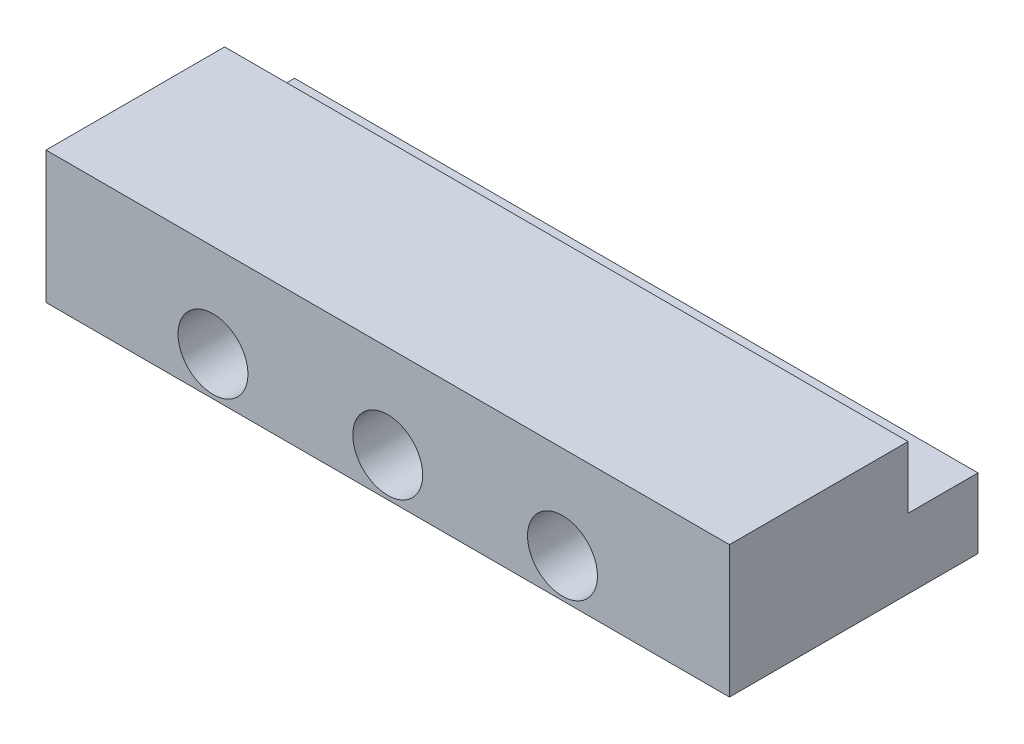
ISO-10303-21;
HEADER;
FILE_DESCRIPTION(('STEP AP214'),'2;1');
FILE_NAME('part.step','',(''),(''),'','','');
FILE_SCHEMA(('AUTOMOTIVE_DESIGN { 1 0 10303 214 1 1 1 1 }'));
ENDSEC;
DATA;
#1=APPLICATION_CONTEXT('core data for automotive mechanical design processes');
#2=APPLICATION_PROTOCOL_DEFINITION('international standard','automotive_design',2000,#1);
#3=PRODUCT_CONTEXT('',#1,'mechanical');
#4=PRODUCT('Part','Part','',(#3));
#5=PRODUCT_RELATED_PRODUCT_CATEGORY('part','',(#4));
#6=PRODUCT_DEFINITION_FORMATION('','',#4);
#7=PRODUCT_DEFINITION_CONTEXT('part definition',#1,'design');
#8=PRODUCT_DEFINITION('design','',#6,#7);
#9=PRODUCT_DEFINITION_SHAPE('','',#8);
#10=(LENGTH_UNIT() NAMED_UNIT(*) SI_UNIT(.MILLI.,.METRE.));
#11=(NAMED_UNIT(*) PLANE_ANGLE_UNIT() SI_UNIT($,.RADIAN.));
#12=(NAMED_UNIT(*) SI_UNIT($,.STERADIAN.) SOLID_ANGLE_UNIT());
#13=UNCERTAINTY_MEASURE_WITH_UNIT(LENGTH_MEASURE(1.E-05),#10,'distance_accuracy_value','');
#14=(GEOMETRIC_REPRESENTATION_CONTEXT(3) GLOBAL_UNCERTAINTY_ASSIGNED_CONTEXT((#13)) GLOBAL_UNIT_ASSIGNED_CONTEXT((#10,
#11,#12)) REPRESENTATION_CONTEXT('',''));
#15=CARTESIAN_POINT('',(0.,0.,0.));
#16=DIRECTION('',(0.,0.,1.));
#17=DIRECTION('',(1.,0.,0.));
#18=AXIS2_PLACEMENT_3D('',#15,#16,#17);
#19=CARTESIAN_POINT('',(-110.,85.25,-40.));
#20=DIRECTION('',(-1.,0.,0.));
#21=DIRECTION('',(0.,-1.,0.));
#22=AXIS2_PLACEMENT_3D('',#19,#20,#21);
#23=PLANE('',#22);
#24=DIRECTION('',(0.,-1.,0.));
#25=VECTOR('',#24,1.);
#26=CARTESIAN_POINT('',(-110.000000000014,-67.8500000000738,-25.));
#27=LINE('',#26,#25);
#28=CARTESIAN_POINT('',(-110.000000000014,-61.85,-25.));
#29=VERTEX_POINT('',#28);
#30=CARTESIAN_POINT('',(-110.000000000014,-69.85,-25.));
#31=VERTEX_POINT('',#30);
#32=EDGE_CURVE('E100',#29,#31,#27,.T.);
#33=ORIENTED_EDGE('',*,*,#32,.F.);
#34=DIRECTION('',(0.,0.,-1.));
#35=VECTOR('',#34,1.);
#36=CARTESIAN_POINT('',(-110.000000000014,-61.85,-25.));
#37=LINE('',#36,#35);
#38=CARTESIAN_POINT('',(-110.000000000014,-61.85,-2.));
#39=VERTEX_POINT('',#38);
#40=EDGE_CURVE('E25',#39,#29,#37,.T.);
#41=ORIENTED_EDGE('',*,*,#40,.F.);
#42=DIRECTION('',(0.,1.,0.));
#43=VECTOR('',#42,1.);
#44=CARTESIAN_POINT('',(-110.000000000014,-59.8500000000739,-2.));
#45=LINE('',#44,#43);
#46=CARTESIAN_POINT('',(-110.000000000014,-78.85,-2.));
#47=VERTEX_POINT('',#46);
#48=EDGE_CURVE('E106',#47,#39,#45,.T.);
#49=ORIENTED_EDGE('',*,*,#48,.F.);
#50=DIRECTION('',(0.,0.,1.));
#51=VECTOR('',#50,1.);
#52=CARTESIAN_POINT('',(-110.000000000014,-78.85,-2.));
#53=LINE('',#52,#51);
#54=CARTESIAN_POINT('',(-110.000000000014,-78.85,-34.));
#55=VERTEX_POINT('',#54);
#56=EDGE_CURVE('E105',#55,#47,#53,.T.);
#57=ORIENTED_EDGE('',*,*,#56,.F.);
#58=DIRECTION('',(0.,-1.,0.));
#59=VECTOR('',#58,1.);
#60=CARTESIAN_POINT('',(-110.000000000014,-79.8500000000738,-34.));
#61=LINE('',#60,#59);
#62=CARTESIAN_POINT('',(-110.000000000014,-69.85,-34.));
#63=VERTEX_POINT('',#62);
#64=EDGE_CURVE('E73',#63,#55,#61,.T.);
#65=ORIENTED_EDGE('',*,*,#64,.F.);
#66=DIRECTION('',(0.,0.,-1.));
#67=VECTOR('',#66,1.);
#68=CARTESIAN_POINT('',(-110.000000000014,-69.85,-34.));
#69=LINE('',#68,#67);
#70=EDGE_CURVE('E102',#31,#63,#69,.T.);
#71=ORIENTED_EDGE('',*,*,#70,.F.);
#72=EDGE_LOOP('',(#33,#41,#49,#57,#65,#71));
#73=FACE_BOUND('',#72,.T.);
#74=ADVANCED_FACE('F16',(#73),#23,.F.);
#75=CARTESIAN_POINT('',(494802.,-59.85,-2.));
#76=DIRECTION('',(0.,0.,-1.));
#77=DIRECTION('',(-1.,0.,0.));
#78=AXIS2_PLACEMENT_3D('',#75,#76,#77);
#79=PLANE('',#78);
#80=CARTESIAN_POINT('',(-154.000000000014,-73.85,-2.));
#81=DIRECTION('',(0.,0.,-1.));
#82=DIRECTION('',(-1.,0.,0.));
#83=AXIS2_PLACEMENT_3D('',#80,#81,#82);
#84=CIRCLE('',#83,4.5);
#85=CARTESIAN_POINT('',(-158.500000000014,-73.85,-2.));
#86=VERTEX_POINT('',#85);
#87=EDGE_CURVE('E212',#86,#86,#84,.T.);
#88=ORIENTED_EDGE('',*,*,#87,.T.);
#89=EDGE_LOOP('',(#88));
#90=FACE_BOUND('',#89,.T.);
#91=CARTESIAN_POINT('',(-131.5,-73.85,-2.));
#92=DIRECTION('',(0.,0.,-1.));
#93=DIRECTION('',(-1.,0.,0.));
#94=AXIS2_PLACEMENT_3D('',#91,#92,#93);
#95=CIRCLE('',#94,4.5);
#96=CARTESIAN_POINT('',(-136.,-73.85,-2.));
#97=VERTEX_POINT('',#96);
#98=EDGE_CURVE('E127',#97,#97,#95,.T.);
#99=ORIENTED_EDGE('',*,*,#98,.T.);
#100=EDGE_LOOP('',(#99));
#101=FACE_BOUND('',#100,.T.);
#102=CARTESIAN_POINT('',(-176.5,-73.85,-2.));
#103=DIRECTION('',(0.,0.,-1.));
#104=DIRECTION('',(-1.,0.,0.));
#105=AXIS2_PLACEMENT_3D('',#102,#103,#104);
#106=CIRCLE('',#105,4.5);
#107=CARTESIAN_POINT('',(-181.,-73.85,-2.));
#108=VERTEX_POINT('',#107);
#109=EDGE_CURVE('E116',#108,#108,#106,.T.);
#110=ORIENTED_EDGE('',*,*,#109,.T.);
#111=EDGE_LOOP('',(#110));
#112=FACE_BOUND('',#111,.T.);
#113=DIRECTION('',(-1.,0.,0.));
#114=VECTOR('',#113,1.);
#115=CARTESIAN_POINT('',(494802.,-78.85,-2.));
#116=LINE('',#115,#114);
#117=CARTESIAN_POINT('',(-198.,-78.85,-2.));
#118=VERTEX_POINT('',#117);
#119=EDGE_CURVE('E76',#47,#118,#116,.T.);
#120=ORIENTED_EDGE('',*,*,#119,.F.);
#121=ORIENTED_EDGE('',*,*,#48,.T.);
#122=DIRECTION('',(-1.,0.,0.));
#123=VECTOR('',#122,1.);
#124=CARTESIAN_POINT('',(494802.,-61.85,-2.));
#125=LINE('',#124,#123);
#126=CARTESIAN_POINT('',(-198.,-61.85,-2.));
#127=VERTEX_POINT('',#126);
#128=EDGE_CURVE('E103',#39,#127,#125,.T.);
#129=ORIENTED_EDGE('',*,*,#128,.T.);
#130=DIRECTION('',(0.,-1.,0.));
#131=VECTOR('',#130,1.);
#132=CARTESIAN_POINT('',(-198.,-59.85,-2.));
#133=LINE('',#132,#131);
#134=EDGE_CURVE('E86',#127,#118,#133,.T.);
#135=ORIENTED_EDGE('',*,*,#134,.T.);
#136=EDGE_LOOP('',(#120,#121,#129,#135));
#137=FACE_BOUND('',#136,.T.);
#138=ADVANCED_FACE('F151',(#90,#101,#112,#137),#79,.F.);
#139=CARTESIAN_POINT('',(494802.,-78.85,-2.));
#140=DIRECTION('',(0.,1.,0.));
#141=DIRECTION('',(0.,0.,1.));
#142=AXIS2_PLACEMENT_3D('',#139,#140,#141);
#143=PLANE('',#142);
#144=DIRECTION('',(-1.,0.,0.));
#145=VECTOR('',#144,1.);
#146=CARTESIAN_POINT('',(494802.,-78.85,-34.));
#147=LINE('',#146,#145);
#148=CARTESIAN_POINT('',(-198.,-78.85,-34.));
#149=VERTEX_POINT('',#148);
#150=EDGE_CURVE('E65',#55,#149,#147,.T.);
#151=ORIENTED_EDGE('',*,*,#150,.F.);
#152=ORIENTED_EDGE('',*,*,#56,.T.);
#153=ORIENTED_EDGE('',*,*,#119,.T.);
#154=DIRECTION('',(0.,0.,-1.));
#155=VECTOR('',#154,1.);
#156=CARTESIAN_POINT('',(-198.,-78.85,-2.));
#157=LINE('',#156,#155);
#158=EDGE_CURVE('E80',#118,#149,#157,.T.);
#159=ORIENTED_EDGE('',*,*,#158,.T.);
#160=EDGE_LOOP('',(#151,#152,#153,#159));
#161=FACE_BOUND('',#160,.T.);
#162=ADVANCED_FACE('F81',(#161),#143,.F.);
#163=CARTESIAN_POINT('',(494802.,-79.85,-34.));
#164=DIRECTION('',(0.,0.,1.));
#165=DIRECTION('',(1.,0.,0.));
#166=AXIS2_PLACEMENT_3D('',#163,#164,#165);
#167=PLANE('',#166);
#168=CARTESIAN_POINT('',(-154.000000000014,-73.85,-34.));
#169=DIRECTION('',(0.,0.,1.));
#170=DIRECTION('',(1.,0.,0.));
#171=AXIS2_PLACEMENT_3D('',#168,#169,#170);
#172=CIRCLE('',#171,2.5);
#173=CARTESIAN_POINT('',(-151.500000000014,-73.85,-34.));
#174=VERTEX_POINT('',#173);
#175=EDGE_CURVE('E20',#174,#174,#172,.T.);
#176=ORIENTED_EDGE('',*,*,#175,.T.);
#177=EDGE_LOOP('',(#176));
#178=FACE_BOUND('',#177,.T.);
#179=CARTESIAN_POINT('',(-131.5,-73.85,-34.));
#180=DIRECTION('',(0.,0.,1.));
#181=DIRECTION('',(1.,0.,0.));
#182=AXIS2_PLACEMENT_3D('',#179,#180,#181);
#183=CIRCLE('',#182,2.75);
#184=CARTESIAN_POINT('',(-128.75,-73.85,-34.));
#185=VERTEX_POINT('',#184);
#186=EDGE_CURVE('E112',#185,#185,#183,.T.);
#187=ORIENTED_EDGE('',*,*,#186,.T.);
#188=EDGE_LOOP('',(#187));
#189=FACE_BOUND('',#188,.T.);
#190=CARTESIAN_POINT('',(-176.5,-73.85,-34.));
#191=DIRECTION('',(0.,0.,1.));
#192=DIRECTION('',(1.,0.,0.));
#193=AXIS2_PLACEMENT_3D('',#190,#191,#192);
#194=CIRCLE('',#193,2.75);
#195=CARTESIAN_POINT('',(-173.75,-73.85,-34.));
#196=VERTEX_POINT('',#195);
#197=EDGE_CURVE('E120',#196,#196,#194,.T.);
#198=ORIENTED_EDGE('',*,*,#197,.T.);
#199=EDGE_LOOP('',(#198));
#200=FACE_BOUND('',#199,.T.);
#201=DIRECTION('',(-1.,0.,0.));
#202=VECTOR('',#201,1.);
#203=CARTESIAN_POINT('',(494802.,-69.85,-34.));
#204=LINE('',#203,#202);
#205=CARTESIAN_POINT('',(-198.,-69.85,-34.));
#206=VERTEX_POINT('',#205);
#207=EDGE_CURVE('E77',#63,#206,#204,.T.);
#208=ORIENTED_EDGE('',*,*,#207,.F.);
#209=ORIENTED_EDGE('',*,*,#64,.T.);
#210=ORIENTED_EDGE('',*,*,#150,.T.);
#211=DIRECTION('',(0.,1.,0.));
#212=VECTOR('',#211,1.);
#213=CARTESIAN_POINT('',(-198.,-79.85,-34.));
#214=LINE('',#213,#212);
#215=EDGE_CURVE('E70',#149,#206,#214,.T.);
#216=ORIENTED_EDGE('',*,*,#215,.T.);
#217=EDGE_LOOP('',(#208,#209,#210,#216));
#218=FACE_BOUND('',#217,.T.);
#219=ADVANCED_FACE('F68',(#178,#189,#200,#218),#167,.F.);
#220=CARTESIAN_POINT('',(-198.,-59.85,-2.));
#221=DIRECTION('',(1.,0.,0.));
#222=DIRECTION('',(0.,0.,-1.));
#223=AXIS2_PLACEMENT_3D('',#220,#221,#222);
#224=PLANE('',#223);
#225=DIRECTION('',(0.,0.,1.));
#226=VECTOR('',#225,1.);
#227=CARTESIAN_POINT('',(-198.,-61.85,-25.));
#228=LINE('',#227,#226);
#229=CARTESIAN_POINT('',(-198.,-61.85,-25.));
#230=VERTEX_POINT('',#229);
#231=EDGE_CURVE('E124',#230,#127,#228,.T.);
#232=ORIENTED_EDGE('',*,*,#231,.F.);
#233=DIRECTION('',(0.,1.,0.));
#234=VECTOR('',#233,1.);
#235=CARTESIAN_POINT('',(-198.,-67.85,-25.));
#236=LINE('',#235,#234);
#237=CARTESIAN_POINT('',(-198.,-69.85,-25.));
#238=VERTEX_POINT('',#237);
#239=EDGE_CURVE('E93',#238,#230,#236,.T.);
#240=ORIENTED_EDGE('',*,*,#239,.F.);
#241=DIRECTION('',(0.,0.,1.));
#242=VECTOR('',#241,1.);
#243=CARTESIAN_POINT('',(-198.,-69.85,-34.));
#244=LINE('',#243,#242);
#245=EDGE_CURVE('E91',#206,#238,#244,.T.);
#246=ORIENTED_EDGE('',*,*,#245,.F.);
#247=ORIENTED_EDGE('',*,*,#215,.F.);
#248=ORIENTED_EDGE('',*,*,#158,.F.);
#249=ORIENTED_EDGE('',*,*,#134,.F.);
#250=EDGE_LOOP('',(#232,#240,#246,#247,#248,#249));
#251=FACE_BOUND('',#250,.T.);
#252=ADVANCED_FACE('F89',(#251),#224,.F.);
#253=CARTESIAN_POINT('',(494802.,-69.85,-34.));
#254=DIRECTION('',(0.,-1.,0.));
#255=DIRECTION('',(0.,0.,-1.));
#256=AXIS2_PLACEMENT_3D('',#253,#254,#255);
#257=PLANE('',#256);
#258=DIRECTION('',(-1.,0.,0.));
#259=VECTOR('',#258,1.);
#260=CARTESIAN_POINT('',(494802.,-69.85,-25.));
#261=LINE('',#260,#259);
#262=EDGE_CURVE('E99',#31,#238,#261,.T.);
#263=ORIENTED_EDGE('',*,*,#262,.F.);
#264=ORIENTED_EDGE('',*,*,#70,.T.);
#265=ORIENTED_EDGE('',*,*,#207,.T.);
#266=ORIENTED_EDGE('',*,*,#245,.T.);
#267=EDGE_LOOP('',(#263,#264,#265,#266));
#268=FACE_BOUND('',#267,.T.);
#269=ADVANCED_FACE('F18',(#268),#257,.F.);
#270=CARTESIAN_POINT('',(494802.,-61.85,-25.));
#271=DIRECTION('',(0.,-1.,0.));
#272=DIRECTION('',(0.,0.,-1.));
#273=AXIS2_PLACEMENT_3D('',#270,#271,#272);
#274=PLANE('',#273);
#275=DIRECTION('',(1.,0.,0.));
#276=VECTOR('',#275,1.);
#277=CARTESIAN_POINT('',(494802.,-61.85,-25.));
#278=LINE('',#277,#276);
#279=EDGE_CURVE('E11',#230,#29,#278,.T.);
#280=ORIENTED_EDGE('',*,*,#279,.F.);
#281=ORIENTED_EDGE('',*,*,#231,.T.);
#282=ORIENTED_EDGE('',*,*,#128,.F.);
#283=ORIENTED_EDGE('',*,*,#40,.T.);
#284=EDGE_LOOP('',(#280,#281,#282,#283));
#285=FACE_BOUND('',#284,.T.);
#286=ADVANCED_FACE('F152',(#285),#274,.F.);
#287=CARTESIAN_POINT('',(494802.,-67.85,-25.));
#288=DIRECTION('',(0.,0.,1.));
#289=DIRECTION('',(1.,0.,0.));
#290=AXIS2_PLACEMENT_3D('',#287,#288,#289);
#291=PLANE('',#290);
#292=ORIENTED_EDGE('',*,*,#239,.T.);
#293=ORIENTED_EDGE('',*,*,#279,.T.);
#294=ORIENTED_EDGE('',*,*,#32,.T.);
#295=ORIENTED_EDGE('',*,*,#262,.T.);
#296=EDGE_LOOP('',(#292,#293,#294,#295));
#297=FACE_BOUND('',#296,.T.);
#298=ADVANCED_FACE('F153',(#297),#291,.F.);
#299=CARTESIAN_POINT('',(-176.5,-73.85,-65.4454423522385));
#300=DIRECTION('',(0.,0.,-1.));
#301=DIRECTION('',(-1.,0.,0.));
#302=AXIS2_PLACEMENT_3D('',#299,#300,#301);
#303=CYLINDRICAL_SURFACE('',#302,2.75);
#304=CARTESIAN_POINT('',(-176.5,-73.85,-22.));
#305=DIRECTION('',(0.,0.,-1.));
#306=DIRECTION('',(-1.,0.,0.));
#307=AXIS2_PLACEMENT_3D('',#304,#305,#306);
#308=CIRCLE('',#307,2.75);
#309=CARTESIAN_POINT('',(-179.25,-73.85,-22.));
#310=VERTEX_POINT('',#309);
#311=EDGE_CURVE('E117',#310,#310,#308,.T.);
#312=ORIENTED_EDGE('',*,*,#311,.F.);
#313=EDGE_LOOP('',(#312));
#314=FACE_BOUND('',#313,.T.);
#315=ORIENTED_EDGE('',*,*,#197,.F.);
#316=EDGE_LOOP('',(#315));
#317=FACE_BOUND('',#316,.T.);
#318=ADVANCED_FACE('F155',(#314,#317),#303,.F.);
#319=CARTESIAN_POINT('',(-176.5,-73.85,-22.));
#320=DIRECTION('',(0.,0.,-1.));
#321=DIRECTION('',(-1.,0.,0.));
#322=AXIS2_PLACEMENT_3D('',#319,#320,#321);
#323=PLANE('',#322);
#324=ORIENTED_EDGE('',*,*,#311,.T.);
#325=EDGE_LOOP('',(#324));
#326=FACE_BOUND('',#325,.T.);
#327=CARTESIAN_POINT('',(-176.5,-73.85,-22.));
#328=DIRECTION('',(0.,0.,-1.));
#329=DIRECTION('',(-1.,0.,0.));
#330=AXIS2_PLACEMENT_3D('',#327,#328,#329);
#331=CIRCLE('',#330,4.5);
#332=CARTESIAN_POINT('',(-181.,-73.85,-22.));
#333=VERTEX_POINT('',#332);
#334=EDGE_CURVE('E121',#333,#333,#331,.T.);
#335=ORIENTED_EDGE('',*,*,#334,.F.);
#336=EDGE_LOOP('',(#335));
#337=FACE_BOUND('',#336,.T.);
#338=ADVANCED_FACE('F162',(#326,#337),#323,.F.);
#339=CARTESIAN_POINT('',(-176.5,-73.85,-2.));
#340=DIRECTION('',(0.,0.,-1.));
#341=DIRECTION('',(-1.,0.,0.));
#342=AXIS2_PLACEMENT_3D('',#339,#340,#341);
#343=CYLINDRICAL_SURFACE('',#342,4.5);
#344=ORIENTED_EDGE('',*,*,#334,.T.);
#345=EDGE_LOOP('',(#344));
#346=FACE_BOUND('',#345,.T.);
#347=ORIENTED_EDGE('',*,*,#109,.F.);
#348=EDGE_LOOP('',(#347));
#349=FACE_BOUND('',#348,.T.);
#350=ADVANCED_FACE('F178',(#346,#349),#343,.F.);
#351=CARTESIAN_POINT('',(-131.5,-73.85,-65.445442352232));
#352=DIRECTION('',(0.,0.,-1.));
#353=DIRECTION('',(-1.,0.,0.));
#354=AXIS2_PLACEMENT_3D('',#351,#352,#353);
#355=CYLINDRICAL_SURFACE('',#354,2.75);
#356=CARTESIAN_POINT('',(-131.5,-73.85,-22.));
#357=DIRECTION('',(0.,0.,-1.));
#358=DIRECTION('',(-1.,0.,0.));
#359=AXIS2_PLACEMENT_3D('',#356,#357,#358);
#360=CIRCLE('',#359,2.75);
#361=CARTESIAN_POINT('',(-134.25,-73.85,-22.));
#362=VERTEX_POINT('',#361);
#363=EDGE_CURVE('E109',#362,#362,#360,.T.);
#364=ORIENTED_EDGE('',*,*,#363,.F.);
#365=EDGE_LOOP('',(#364));
#366=FACE_BOUND('',#365,.T.);
#367=ORIENTED_EDGE('',*,*,#186,.F.);
#368=EDGE_LOOP('',(#367));
#369=FACE_BOUND('',#368,.T.);
#370=ADVANCED_FACE('F175',(#366,#369),#355,.F.);
#371=CARTESIAN_POINT('',(-131.5,-73.85,-22.));
#372=DIRECTION('',(0.,0.,-1.));
#373=DIRECTION('',(-1.,0.,0.));
#374=AXIS2_PLACEMENT_3D('',#371,#372,#373);
#375=PLANE('',#374);
#376=ORIENTED_EDGE('',*,*,#363,.T.);
#377=EDGE_LOOP('',(#376));
#378=FACE_BOUND('',#377,.T.);
#379=CARTESIAN_POINT('',(-131.5,-73.85,-22.));
#380=DIRECTION('',(0.,0.,-1.));
#381=DIRECTION('',(-1.,0.,0.));
#382=AXIS2_PLACEMENT_3D('',#379,#380,#381);
#383=CIRCLE('',#382,4.5);
#384=CARTESIAN_POINT('',(-136.,-73.85,-22.));
#385=VERTEX_POINT('',#384);
#386=EDGE_CURVE('E113',#385,#385,#383,.T.);
#387=ORIENTED_EDGE('',*,*,#386,.F.);
#388=EDGE_LOOP('',(#387));
#389=FACE_BOUND('',#388,.T.);
#390=ADVANCED_FACE('F177',(#378,#389),#375,.F.);
#391=CARTESIAN_POINT('',(-131.5,-73.85,-2.));
#392=DIRECTION('',(0.,0.,-1.));
#393=DIRECTION('',(-1.,0.,0.));
#394=AXIS2_PLACEMENT_3D('',#391,#392,#393);
#395=CYLINDRICAL_SURFACE('',#394,4.5);
#396=ORIENTED_EDGE('',*,*,#386,.T.);
#397=EDGE_LOOP('',(#396));
#398=FACE_BOUND('',#397,.T.);
#399=ORIENTED_EDGE('',*,*,#98,.F.);
#400=EDGE_LOOP('',(#399));
#401=FACE_BOUND('',#400,.T.);
#402=ADVANCED_FACE('F181',(#398,#401),#395,.F.);
#403=CARTESIAN_POINT('',(-154.000000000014,-73.85,-52.));
#404=DIRECTION('',(0.,0.,-1.));
#405=DIRECTION('',(-1.,0.,0.));
#406=AXIS2_PLACEMENT_3D('',#403,#404,#405);
#407=CYLINDRICAL_SURFACE('',#406,2.5);
#408=CARTESIAN_POINT('',(-154.000000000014,-73.85,-22.));
#409=DIRECTION('',(0.,0.,-1.));
#410=DIRECTION('',(-1.,0.,0.));
#411=AXIS2_PLACEMENT_3D('',#408,#409,#410);
#412=CIRCLE('',#411,2.5);
#413=CARTESIAN_POINT('',(-156.500000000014,-73.85,-22.));
#414=VERTEX_POINT('',#413);
#415=EDGE_CURVE('E206',#414,#414,#412,.T.);
#416=ORIENTED_EDGE('',*,*,#415,.F.);
#417=EDGE_LOOP('',(#416));
#418=FACE_BOUND('',#417,.T.);
#419=ORIENTED_EDGE('',*,*,#175,.F.);
#420=EDGE_LOOP('',(#419));
#421=FACE_BOUND('',#420,.T.);
#422=ADVANCED_FACE('F184',(#418,#421),#407,.F.);
#423=CARTESIAN_POINT('',(-154.000000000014,-73.85,-22.));
#424=DIRECTION('',(0.,0.,-1.));
#425=DIRECTION('',(-1.,0.,0.));
#426=AXIS2_PLACEMENT_3D('',#423,#424,#425);
#427=PLANE('',#426);
#428=ORIENTED_EDGE('',*,*,#415,.T.);
#429=EDGE_LOOP('',(#428));
#430=FACE_BOUND('',#429,.T.);
#431=CARTESIAN_POINT('',(-154.000000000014,-73.85,-22.));
#432=DIRECTION('',(0.,0.,-1.));
#433=DIRECTION('',(-1.,0.,0.));
#434=AXIS2_PLACEMENT_3D('',#431,#432,#433);
#435=CIRCLE('',#434,4.5);
#436=CARTESIAN_POINT('',(-158.500000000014,-73.85,-22.));
#437=VERTEX_POINT('',#436);
#438=EDGE_CURVE('E208',#437,#437,#435,.T.);
#439=ORIENTED_EDGE('',*,*,#438,.F.);
#440=EDGE_LOOP('',(#439));
#441=FACE_BOUND('',#440,.T.);
#442=ADVANCED_FACE('F221',(#430,#441),#427,.F.);
#443=CARTESIAN_POINT('',(-154.000000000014,-73.85,-2.));
#444=DIRECTION('',(0.,0.,-1.));
#445=DIRECTION('',(-1.,0.,0.));
#446=AXIS2_PLACEMENT_3D('',#443,#444,#445);
#447=CYLINDRICAL_SURFACE('',#446,4.5);
#448=ORIENTED_EDGE('',*,*,#438,.T.);
#449=EDGE_LOOP('',(#448));
#450=FACE_BOUND('',#449,.T.);
#451=ORIENTED_EDGE('',*,*,#87,.F.);
#452=EDGE_LOOP('',(#451));
#453=FACE_BOUND('',#452,.T.);
#454=ADVANCED_FACE('F219',(#450,#453),#447,.F.);
#455=CLOSED_SHELL('',(#74,#138,#162,#219,#252,#269,#286,#298,#318,#338,#350,#370,#390,#402,#422,
#442,#454));
#456=MANIFOLD_SOLID_BREP('B1',#455);
#457=ADVANCED_BREP_SHAPE_REPRESENTATION('',(#18,#456),#14);
#458=SHAPE_DEFINITION_REPRESENTATION(#9,#457);
ENDSEC;
END-ISO-10303-21;
